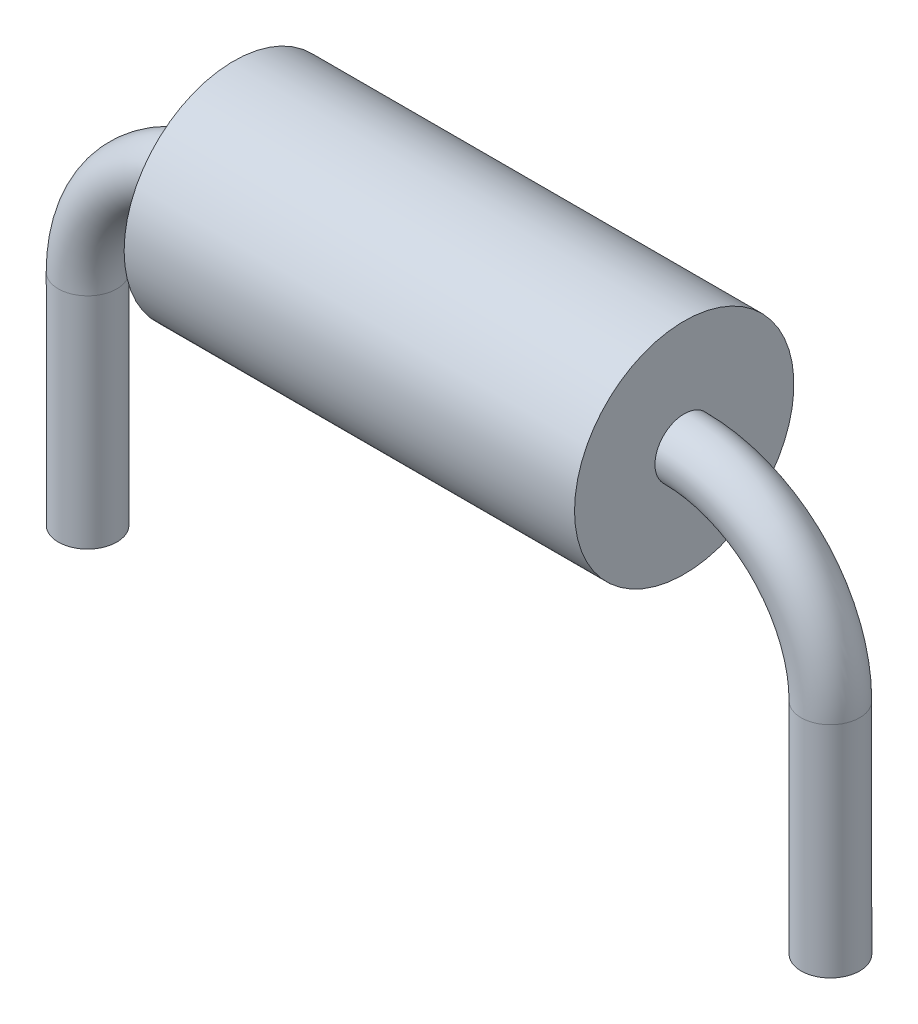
from build123d import *

# Parameters (mm, degrees)
SKIZZE2_R = 0.4
SKIZZE3_W = 6.16
SKIZZE3_H = 1.5


with BuildPart() as part:
    # Austragung1: sweep along a path in Skizze1
    with BuildLine(Plane.XY) as austragung1_path:
        Line((0, 0), (0, 3))
        ThreePointArc((0, 3), (0.585786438, 4.414213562), (2, 5))
        Line((2, 5), (8.16, 5))
        ThreePointArc((8.16, 5), (9.574213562, 4.414213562), (10.16, 3))
        Line((10.16, 3), (10.16, 0))
    # Skizze2 → Austragung1 (sweep)
    with BuildSketch(Plane(origin=(0, 0, 0), x_dir=(1, 0, 0), z_dir=(0, 1, 0))):
        Circle(SKIZZE2_R)
    sweep(path=austragung1_path.line)

    # Skizze3 → Rotation1 (revolve)
    with BuildSketch(Plane.XY, mode=Mode.PRIVATE) as rotation1_sk:
        with Locations((5.08, 5.75)):
            Rectangle(SKIZZE3_W, SKIZZE3_H)
    revolve(rotation1_sk.sketch.rotate(Axis((2, 5, 0), (1, 0, 0)), 90), axis=Axis((2, 5, 0), (1, 0, 0)))


solid = part.part
